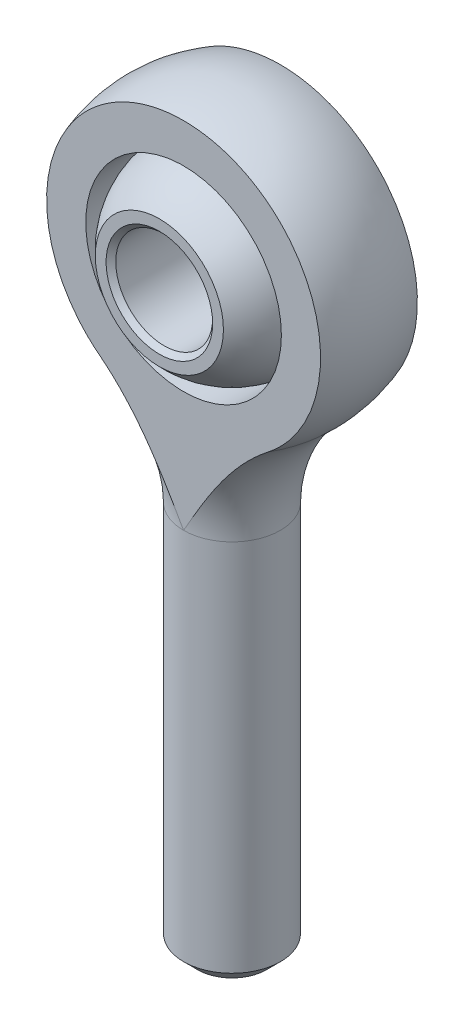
ISO-10303-21;
HEADER;
FILE_DESCRIPTION(('STEP AP214'),'2;1');
FILE_NAME('part.step','',(''),(''),'','','');
FILE_SCHEMA(('AUTOMOTIVE_DESIGN { 1 0 10303 214 1 1 1 1 }'));
ENDSEC;
DATA;
#1=APPLICATION_CONTEXT('core data for automotive mechanical design processes');
#2=APPLICATION_PROTOCOL_DEFINITION('international standard','automotive_design',2000,#1);
#3=PRODUCT_CONTEXT('',#1,'mechanical');
#4=PRODUCT('Part','Part','',(#3));
#5=PRODUCT_RELATED_PRODUCT_CATEGORY('part','',(#4));
#6=PRODUCT_DEFINITION_FORMATION('','',#4);
#7=PRODUCT_DEFINITION_CONTEXT('part definition',#1,'design');
#8=PRODUCT_DEFINITION('design','',#6,#7);
#9=PRODUCT_DEFINITION_SHAPE('','',#8);
#10=(LENGTH_UNIT() NAMED_UNIT(*) SI_UNIT(.MILLI.,.METRE.));
#11=(NAMED_UNIT(*) PLANE_ANGLE_UNIT() SI_UNIT($,.RADIAN.));
#12=(NAMED_UNIT(*) SI_UNIT($,.STERADIAN.) SOLID_ANGLE_UNIT());
#13=UNCERTAINTY_MEASURE_WITH_UNIT(LENGTH_MEASURE(1.E-05),#10,'distance_accuracy_value','');
#14=(GEOMETRIC_REPRESENTATION_CONTEXT(3) GLOBAL_UNCERTAINTY_ASSIGNED_CONTEXT((#13)) GLOBAL_UNIT_ASSIGNED_CONTEXT((#10,
#11,#12)) REPRESENTATION_CONTEXT('',''));
#15=CARTESIAN_POINT('',(0.,0.,0.));
#16=DIRECTION('',(0.,0.,1.));
#17=DIRECTION('',(1.,0.,0.));
#18=AXIS2_PLACEMENT_3D('',#15,#16,#17);
#19=CARTESIAN_POINT('',(0.,14.2875,0.));
#20=DIRECTION('',(0.,-1.,0.));
#21=DIRECTION('',(-1.,0.,0.));
#22=AXIS2_PLACEMENT_3D('',#19,#20,#21);
#23=SPHERICAL_SURFACE('',#22,6.35);
#24=CARTESIAN_POINT('',(0.,14.2875,0.));
#25=DIRECTION('',(0.,0.,1.));
#26=DIRECTION('',(0.,-1.,0.));
#27=AXIS2_PLACEMENT_3D('',#24,#25,#26);
#28=SPHERICAL_SURFACE('',#27,6.35);
#29=CARTESIAN_POINT('',(0.,14.2875,-4.7625));
#30=DIRECTION('',(0.,0.,1.));
#31=DIRECTION('',(0.,-1.,0.));
#32=AXIS2_PLACEMENT_3D('',#29,#30,#31);
#33=CIRCLE('',#32,4.20013020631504);
#34=CARTESIAN_POINT('',(0.,10.087369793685,-4.7625));
#35=VERTEX_POINT('',#34);
#36=EDGE_CURVE('E63',#35,#35,#33,.F.);
#37=ORIENTED_EDGE('',*,*,#36,.F.);
#38=EDGE_LOOP('',(#37));
#39=FACE_BOUND('',#38,.T.);
#40=CARTESIAN_POINT('',(0.,14.2875,4.7625));
#41=DIRECTION('',(0.,0.,-1.));
#42=DIRECTION('',(0.,1.,0.));
#43=AXIS2_PLACEMENT_3D('',#40,#41,#42);
#44=CIRCLE('',#43,4.20013020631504);
#45=CARTESIAN_POINT('',(0.,18.487630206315,4.7625));
#46=VERTEX_POINT('',#45);
#47=EDGE_CURVE('E62',#46,#46,#44,.F.);
#48=ORIENTED_EDGE('',*,*,#47,.F.);
#49=EDGE_LOOP('',(#48));
#50=FACE_BOUND('',#49,.T.);
#51=ADVANCED_FACE('F42',(#39,#50),#28,.T.);
#52=CARTESIAN_POINT('',(-9.525,23.8125,4.7625));
#53=DIRECTION('',(0.,0.,-1.));
#54=DIRECTION('',(0.,1.,0.));
#55=AXIS2_PLACEMENT_3D('',#52,#53,#54);
#56=PLANE('',#55);
#57=CARTESIAN_POINT('',(0.,14.2875,4.7625));
#58=DIRECTION('',(0.,0.,-1.));
#59=DIRECTION('',(0.,1.,0.));
#60=AXIS2_PLACEMENT_3D('',#57,#58,#59);
#61=CIRCLE('',#60,3.4925);
#62=CARTESIAN_POINT('',(0.,17.78,4.7625));
#63=VERTEX_POINT('',#62);
#64=EDGE_CURVE('E11',#63,#63,#61,.T.);
#65=ORIENTED_EDGE('',*,*,#64,.T.);
#66=EDGE_LOOP('',(#65));
#67=FACE_BOUND('',#66,.T.);
#68=ORIENTED_EDGE('',*,*,#47,.T.);
#69=EDGE_LOOP('',(#68));
#70=FACE_BOUND('',#69,.T.);
#71=ADVANCED_FACE('F69',(#67,#70),#56,.F.);
#72=CARTESIAN_POINT('',(-9.525,23.8125,-4.7625));
#73=DIRECTION('',(0.,0.,1.));
#74=DIRECTION('',(0.,-1.,0.));
#75=AXIS2_PLACEMENT_3D('',#72,#73,#74);
#76=PLANE('',#75);
#77=CARTESIAN_POINT('',(0.,14.2875,-4.7625));
#78=DIRECTION('',(0.,0.,1.));
#79=DIRECTION('',(0.,-1.,0.));
#80=AXIS2_PLACEMENT_3D('',#77,#78,#79);
#81=CIRCLE('',#80,3.4925);
#82=CARTESIAN_POINT('',(0.,10.795,-4.7625));
#83=VERTEX_POINT('',#82);
#84=EDGE_CURVE('E57',#83,#83,#81,.T.);
#85=ORIENTED_EDGE('',*,*,#84,.T.);
#86=EDGE_LOOP('',(#85));
#87=FACE_BOUND('',#86,.T.);
#88=ORIENTED_EDGE('',*,*,#36,.T.);
#89=EDGE_LOOP('',(#88));
#90=FACE_BOUND('',#89,.T.);
#91=ADVANCED_FACE('F77',(#87,#90),#76,.F.);
#92=CARTESIAN_POINT('',(0.,14.2875,-4.7625));
#93=DIRECTION('',(0.,0.,1.));
#94=DIRECTION('',(1.,0.,0.));
#95=AXIS2_PLACEMENT_3D('',#92,#93,#94);
#96=CYLINDRICAL_SURFACE('',#95,3.175);
#97=CARTESIAN_POINT('',(0.,14.2875,-4.445));
#98=DIRECTION('',(0.,0.,1.));
#99=DIRECTION('',(1.,0.,0.));
#100=AXIS2_PLACEMENT_3D('',#97,#98,#99);
#101=CIRCLE('',#100,3.175);
#102=CARTESIAN_POINT('',(3.175,14.2875,-4.445));
#103=VERTEX_POINT('',#102);
#104=EDGE_CURVE('E49',#103,#103,#101,.F.);
#105=ORIENTED_EDGE('',*,*,#104,.T.);
#106=EDGE_LOOP('',(#105));
#107=FACE_BOUND('',#106,.T.);
#108=CARTESIAN_POINT('',(0.,14.2875,4.445));
#109=DIRECTION('',(0.,0.,-1.));
#110=DIRECTION('',(-1.,0.,0.));
#111=AXIS2_PLACEMENT_3D('',#108,#109,#110);
#112=CIRCLE('',#111,3.175);
#113=CARTESIAN_POINT('',(-3.175,14.2875,4.445));
#114=VERTEX_POINT('',#113);
#115=EDGE_CURVE('E53',#114,#114,#112,.F.);
#116=ORIENTED_EDGE('',*,*,#115,.T.);
#117=EDGE_LOOP('',(#116));
#118=FACE_BOUND('',#117,.T.);
#119=ADVANCED_FACE('F83',(#107,#118),#96,.F.);
#120=CARTESIAN_POINT('',(0.,14.2875,-4.7625));
#121=DIRECTION('',(0.,0.,-1.));
#122=DIRECTION('',(-1.,0.,0.));
#123=AXIS2_PLACEMENT_3D('',#120,#121,#122);
#124=CONICAL_SURFACE('',#123,3.4925,0.785398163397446);
#125=ORIENTED_EDGE('',*,*,#104,.F.);
#126=EDGE_LOOP('',(#125));
#127=FACE_BOUND('',#126,.T.);
#128=ORIENTED_EDGE('',*,*,#84,.F.);
#129=EDGE_LOOP('',(#128));
#130=FACE_BOUND('',#129,.T.);
#131=ADVANCED_FACE('F81',(#127,#130),#124,.F.);
#132=CARTESIAN_POINT('',(0.,14.2875,4.445));
#133=DIRECTION('',(0.,0.,1.));
#134=DIRECTION('',(1.,0.,0.));
#135=AXIS2_PLACEMENT_3D('',#132,#133,#134);
#136=CONICAL_SURFACE('',#135,3.175,0.785398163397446);
#137=ORIENTED_EDGE('',*,*,#64,.F.);
#138=EDGE_LOOP('',(#137));
#139=FACE_BOUND('',#138,.T.);
#140=ORIENTED_EDGE('',*,*,#115,.F.);
#141=EDGE_LOOP('',(#140));
#142=FACE_BOUND('',#141,.T.);
#143=ADVANCED_FACE('F44',(#139,#142),#136,.F.);
#144=CLOSED_SHELL('',(#51,#71,#91,#119,#131,#143));
#145=MANIFOLD_SOLID_BREP('B2',#144);
#146=CARTESIAN_POINT('',(0.,0.,0.));
#147=DIRECTION('',(0.,-1.,0.));
#148=DIRECTION('',(1.,0.,0.));
#149=AXIS2_PLACEMENT_3D('',#146,#147,#148);
#150=TOROIDAL_SURFACE('',#149,12.8984375,9.72343750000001);
#151=CARTESIAN_POINT('',(0.,0.,-3.17500000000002));
#152=CARTESIAN_POINT('',(-0.00326153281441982,0.005707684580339,-3.17500000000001));
#153=CARTESIAN_POINT('',(-0.00652306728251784,0.0114153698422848,-3.17500000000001));
#154=CARTESIAN_POINT('',(-0.273129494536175,0.477974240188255,-3.17499999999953));
#155=CARTESIAN_POINT('',(-0.536560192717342,0.938786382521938,-3.17499999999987));
#156=CARTESIAN_POINT('',(-1.07566265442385,1.8532278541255,-3.17500000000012));
#157=CARTESIAN_POINT('',(-1.35133223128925,2.30685844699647,-3.17500000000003));
#158=CARTESIAN_POINT('',(-1.92559609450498,3.19894900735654,-3.17499999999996));
#159=CARTESIAN_POINT('',(-2.22416629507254,3.63742422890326,-3.17499999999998));
#160=CARTESIAN_POINT('',(-2.85309895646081,4.49102276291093,-3.175));
#161=CARTESIAN_POINT('',(-3.18344395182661,4.90615870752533,-3.17499999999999));
#162=CARTESIAN_POINT('',(-3.77466960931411,5.58162755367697,-3.17499999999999));
#163=CARTESIAN_POINT('',(-4.02585009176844,5.85044049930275,-3.17499999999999));
#164=CARTESIAN_POINT('',(-4.54711374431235,6.36901465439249,-3.17499999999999));
#165=CARTESIAN_POINT('',(-4.8171908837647,6.61878188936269,-3.17499999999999));
#166=CARTESIAN_POINT('',(-5.37662445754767,7.09612768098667,-3.17499999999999));
#167=CARTESIAN_POINT('',(-5.66599147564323,7.32369388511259,-3.17499999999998));
#168=CARTESIAN_POINT('',(-6.26322715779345,7.75319037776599,-3.17499999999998));
#169=CARTESIAN_POINT('',(-6.57109562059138,7.95512094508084,-3.17499999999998));
#170=CARTESIAN_POINT('',(-7.20718830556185,8.33213779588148,-3.17499999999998));
#171=CARTESIAN_POINT('',(-7.5355887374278,8.50692791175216,-3.17499999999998));
#172=CARTESIAN_POINT('',(-8.20771747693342,8.8241919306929,-3.17499999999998));
#173=CARTESIAN_POINT('',(-8.55144656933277,8.96666417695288,-3.17499999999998));
#174=CARTESIAN_POINT('',(-9.25110720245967,9.21656726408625,-3.17499999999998));
#175=CARTESIAN_POINT('',(-9.60702765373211,9.32402906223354,-3.17499999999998));
#176=CARTESIAN_POINT('',(-10.3280020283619,9.50191139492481,-3.17499999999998));
#177=CARTESIAN_POINT('',(-10.6930544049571,9.57233815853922,-3.17499999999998));
#178=CARTESIAN_POINT('',(-11.3741481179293,9.66696888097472,-3.17499999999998));
#179=CARTESIAN_POINT('',(-11.6894621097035,9.69646466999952,-3.17499999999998));
#180=CARTESIAN_POINT('',(-12.3214131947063,9.72667494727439,-3.17499999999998));
#181=CARTESIAN_POINT('',(-12.6380499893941,9.72739561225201,-3.17499999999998));
#182=CARTESIAN_POINT('',(-13.2714560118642,9.69958458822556,-3.17499999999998));
#183=CARTESIAN_POINT('',(-13.5882199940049,9.67092754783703,-3.17499999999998));
#184=CARTESIAN_POINT('',(-14.0603016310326,9.60580647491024,-3.17499999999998));
#185=CARTESIAN_POINT('',(-14.2172131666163,9.58039570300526,-3.17499999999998));
#186=CARTESIAN_POINT('',(-14.5296709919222,9.5222100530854,-3.17499999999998));
#187=CARTESIAN_POINT('',(-14.6852172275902,9.48943488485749,-3.17499999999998));
#188=CARTESIAN_POINT('',(-14.8399244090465,9.45298870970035,-3.17499999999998));
#189=B_SPLINE_CURVE_WITH_KNOTS('',3,(#151,#152,#153,#154,#155,#156,#157,#158,#159,#160,#161,
#162,#163,#164,#165,#166,#167,#168,#169,#170,#171,#172,#173,#174,#175,#176,#177,#178,#179,#180,
#181,#182,#183,#184,#185,#186,#187,#188),.UNSPECIFIED.,.F.,.F.,(4,2,2,2,2,2,2,2,2,2,2,2,2,2,2,2,
2,2,4),(0.,0.0197214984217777,1.6120807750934,3.20415668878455,4.79458050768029,
6.38413507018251,7.48699761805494,8.58950979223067,9.692631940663,10.7957420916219,
11.9101519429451,13.0246189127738,14.1380977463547,15.2513892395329,16.2001992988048,
17.1488056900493,18.1014765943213,18.5781908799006,19.0549239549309),.UNSPECIFIED.);
#190=CARTESIAN_POINT('',(0.,0.,-3.175));
#191=VERTEX_POINT('',#190);
#192=CARTESIAN_POINT('',(-5.53702467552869,7.21739690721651,-3.17499999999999));
#193=VERTEX_POINT('',#192);
#194=EDGE_CURVE('E147',#191,#193,#189,.T.);
#195=ORIENTED_EDGE('',*,*,#194,.F.);
#196=CARTESIAN_POINT('',(0.,0.,0.));
#197=DIRECTION('',(0.,1.,0.));
#198=DIRECTION('',(-1.,0.,0.));
#199=AXIS2_PLACEMENT_3D('',#196,#197,#198);
#200=CIRCLE('',#199,3.175);
#201=CARTESIAN_POINT('',(0.,0.,3.175));
#202=VERTEX_POINT('',#201);
#203=EDGE_CURVE('E175',#191,#202,#200,.T.);
#204=ORIENTED_EDGE('',*,*,#203,.T.);
#205=CARTESIAN_POINT('',(0.,0.,3.17500000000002));
#206=CARTESIAN_POINT('',(-0.00326153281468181,0.00570768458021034,3.17500000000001));
#207=CARTESIAN_POINT('',(-0.00652306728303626,0.0114153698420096,3.175));
#208=CARTESIAN_POINT('',(-0.273129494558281,0.477974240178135,3.17499999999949));
#209=CARTESIAN_POINT('',(-0.536560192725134,0.938786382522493,3.17499999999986));
#210=CARTESIAN_POINT('',(-1.07566265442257,1.853227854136,3.17500000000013));
#211=CARTESIAN_POINT('',(-1.35133223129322,2.30685844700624,3.17500000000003));
#212=CARTESIAN_POINT('',(-1.92559609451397,3.19894900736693,3.17499999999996));
#213=CARTESIAN_POINT('',(-2.22416629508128,3.63742422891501,3.17499999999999));
#214=CARTESIAN_POINT('',(-2.85309895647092,4.49102276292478,3.17500000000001));
#215=CARTESIAN_POINT('',(-3.18344395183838,4.90615870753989,3.175));
#216=CARTESIAN_POINT('',(-3.77466960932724,5.58162755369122,3.175));
#217=CARTESIAN_POINT('',(-4.02585009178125,5.85044049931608,3.175));
#218=CARTESIAN_POINT('',(-4.54711374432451,6.36901465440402,3.175));
#219=CARTESIAN_POINT('',(-4.81719088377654,6.61878188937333,3.175));
#220=CARTESIAN_POINT('',(-5.37662445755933,7.0961276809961,3.175));
#221=CARTESIAN_POINT('',(-5.66599147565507,7.32369388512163,3.175));
#222=CARTESIAN_POINT('',(-6.26322715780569,7.75319037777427,3.175));
#223=CARTESIAN_POINT('',(-6.57109562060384,7.95512094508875,3.175));
#224=CARTESIAN_POINT('',(-7.20718830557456,8.33213779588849,3.175));
#225=CARTESIAN_POINT('',(-7.53558873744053,8.50692791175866,3.175));
#226=CARTESIAN_POINT('',(-8.2077174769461,8.82419193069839,3.175));
#227=CARTESIAN_POINT('',(-8.5514465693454,8.96666417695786,3.175));
#228=CARTESIAN_POINT('',(-9.25110720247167,9.21656726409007,3.175));
#229=CARTESIAN_POINT('',(-9.60702765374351,9.32402906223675,3.175));
#230=CARTESIAN_POINT('',(-10.328002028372,9.50191139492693,3.175));
#231=CARTESIAN_POINT('',(-10.6930544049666,9.57233815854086,3.175));
#232=CARTESIAN_POINT('',(-11.3741481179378,9.66696888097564,3.175));
#233=CARTESIAN_POINT('',(-11.6894621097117,9.69646467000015,3.175));
#234=CARTESIAN_POINT('',(-12.3214131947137,9.72667494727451,3.175));
#235=CARTESIAN_POINT('',(-12.6380499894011,9.72739561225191,3.175));
#236=CARTESIAN_POINT('',(-13.2714560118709,9.69958458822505,3.175));
#237=CARTESIAN_POINT('',(-13.5882199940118,9.67092754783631,3.175));
#238=CARTESIAN_POINT('',(-14.0603016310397,9.60580647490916,3.175));
#239=CARTESIAN_POINT('',(-14.2172131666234,9.58039570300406,3.175));
#240=CARTESIAN_POINT('',(-14.5296709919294,9.52221005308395,3.175));
#241=CARTESIAN_POINT('',(-14.6852172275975,9.48943488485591,3.175));
#242=CARTESIAN_POINT('',(-14.8399244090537,9.45298870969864,3.175));
#243=B_SPLINE_CURVE_WITH_KNOTS('',3,(#205,#206,#207,#208,#209,#210,#211,#212,#213,#214,#215,
#216,#217,#218,#219,#220,#221,#222,#223,#224,#225,#226,#227,#228,#229,#230,#231,#232,#233,#234,
#235,#236,#237,#238,#239,#240,#241,#242),.UNSPECIFIED.,.F.,.F.,(4,2,2,2,2,2,2,2,2,2,2,2,2,2,2,2,
2,2,4),(0.,0.0197214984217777,1.61208077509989,3.20415668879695,4.79458050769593,
6.38413507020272,7.48699761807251,8.58950979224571,9.69263194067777,10.7957420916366,
11.9101519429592,13.0246189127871,14.1380977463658,15.2513892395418,16.2001992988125,
17.1488056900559,18.1014765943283,18.5781908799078,19.0549239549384),.UNSPECIFIED.);
#244=CARTESIAN_POINT('',(-5.53702467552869,7.21739690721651,3.175));
#245=VERTEX_POINT('',#244);
#246=EDGE_CURVE('E179',#245,#202,#243,.F.);
#247=ORIENTED_EDGE('',*,*,#246,.F.);
#248=CARTESIAN_POINT('',(0.,7.21739690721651,0.));
#249=DIRECTION('',(0.,-1.,0.));
#250=DIRECTION('',(1.,0.,0.));
#251=AXIS2_PLACEMENT_3D('',#248,#249,#250);
#252=CIRCLE('',#251,6.38273195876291);
#253=EDGE_CURVE('E178',#245,#193,#252,.T.);
#254=ORIENTED_EDGE('',*,*,#253,.T.);
#255=EDGE_LOOP('',(#195,#204,#247,#254));
#256=FACE_BOUND('',#255,.T.);
#257=ADVANCED_FACE('F133',(#256),#150,.F.);
#258=CARTESIAN_POINT('',(0.,-25.4,0.));
#259=DIRECTION('',(0.,1.,0.));
#260=DIRECTION('',(-1.,0.,0.));
#261=AXIS2_PLACEMENT_3D('',#258,#259,#260);
#262=PLANE('',#261);
#263=CARTESIAN_POINT('',(0.,-25.4,0.));
#264=DIRECTION('',(0.,1.,0.));
#265=DIRECTION('',(-1.,0.,0.));
#266=AXIS2_PLACEMENT_3D('',#263,#264,#265);
#267=CIRCLE('',#266,2.26822);
#268=CARTESIAN_POINT('',(-2.26822,-25.4,0.));
#269=VERTEX_POINT('',#268);
#270=EDGE_CURVE('E190',#269,#269,#267,.F.);
#271=ORIENTED_EDGE('',*,*,#270,.T.);
#272=EDGE_LOOP('',(#271));
#273=FACE_BOUND('',#272,.T.);
#274=ADVANCED_FACE('F225',(#273),#262,.F.);
#275=CARTESIAN_POINT('',(0.,23.8125,0.));
#276=DIRECTION('',(0.,1.,0.));
#277=DIRECTION('',(-1.,0.,0.));
#278=AXIS2_PLACEMENT_3D('',#275,#276,#277);
#279=CYLINDRICAL_SURFACE('',#278,3.175);
#280=CARTESIAN_POINT('',(0.,-24.49322,0.));
#281=DIRECTION('',(0.,1.,0.));
#282=DIRECTION('',(-1.,0.,0.));
#283=AXIS2_PLACEMENT_3D('',#280,#281,#282);
#284=CIRCLE('',#283,3.175);
#285=CARTESIAN_POINT('',(-3.175,-24.49322,0.));
#286=VERTEX_POINT('',#285);
#287=EDGE_CURVE('E188',#286,#286,#284,.T.);
#288=ORIENTED_EDGE('',*,*,#287,.T.);
#289=EDGE_LOOP('',(#288));
#290=FACE_BOUND('',#289,.T.);
#291=EDGE_CURVE('E184',#202,#191,#200,.T.);
#292=ORIENTED_EDGE('',*,*,#291,.F.);
#293=ORIENTED_EDGE('',*,*,#203,.F.);
#294=EDGE_LOOP('',(#292,#293));
#295=FACE_BOUND('',#294,.T.);
#296=ADVANCED_FACE('F183',(#290,#295),#279,.T.);
#297=CARTESIAN_POINT('',(0.,-24.49322,0.));
#298=DIRECTION('',(0.,1.,0.));
#299=DIRECTION('',(-1.,0.,0.));
#300=AXIS2_PLACEMENT_3D('',#297,#298,#299);
#301=CONICAL_SURFACE('',#300,3.175,0.785398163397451);
#302=ORIENTED_EDGE('',*,*,#270,.F.);
#303=EDGE_LOOP('',(#302));
#304=FACE_BOUND('',#303,.T.);
#305=ORIENTED_EDGE('',*,*,#287,.F.);
#306=EDGE_LOOP('',(#305));
#307=FACE_BOUND('',#306,.T.);
#308=ADVANCED_FACE('F135',(#304,#307),#301,.T.);
#309=CARTESIAN_POINT('',(0.,0.,-3.17500000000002));
#310=CARTESIAN_POINT('',(0.00326153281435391,0.005707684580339,-3.17500000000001));
#311=CARTESIAN_POINT('',(0.00652306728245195,0.0114153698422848,-3.17500000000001));
#312=CARTESIAN_POINT('',(0.273129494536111,0.477974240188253,-3.17499999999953));
#313=CARTESIAN_POINT('',(0.536560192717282,0.938786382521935,-3.17499999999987));
#314=CARTESIAN_POINT('',(1.07566265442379,1.8532278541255,-3.17500000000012));
#315=CARTESIAN_POINT('',(1.35133223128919,2.30685844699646,-3.17500000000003));
#316=CARTESIAN_POINT('',(1.92559609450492,3.19894900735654,-3.17499999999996));
#317=CARTESIAN_POINT('',(2.22416629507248,3.63742422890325,-3.17499999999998));
#318=CARTESIAN_POINT('',(2.85309895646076,4.49102276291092,-3.175));
#319=CARTESIAN_POINT('',(3.18344395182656,4.90615870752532,-3.17499999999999));
#320=CARTESIAN_POINT('',(3.77466960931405,5.58162755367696,-3.17499999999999));
#321=CARTESIAN_POINT('',(4.02585009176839,5.85044049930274,-3.17499999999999));
#322=CARTESIAN_POINT('',(4.54711374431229,6.36901465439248,-3.17499999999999));
#323=CARTESIAN_POINT('',(4.81719088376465,6.61878188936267,-3.17499999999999));
#324=CARTESIAN_POINT('',(5.37662445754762,7.09612768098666,-3.17499999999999));
#325=CARTESIAN_POINT('',(5.66599147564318,7.32369388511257,-3.17499999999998));
#326=CARTESIAN_POINT('',(6.2632271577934,7.75319037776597,-3.17499999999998));
#327=CARTESIAN_POINT('',(6.57109562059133,7.95512094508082,-3.17499999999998));
#328=CARTESIAN_POINT('',(7.2071883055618,8.33213779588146,-3.17499999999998));
#329=CARTESIAN_POINT('',(7.53558873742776,8.50692791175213,-3.17499999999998));
#330=CARTESIAN_POINT('',(8.20771747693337,8.82419193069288,-3.17499999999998));
#331=CARTESIAN_POINT('',(8.55144656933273,8.96666417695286,-3.17499999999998));
#332=CARTESIAN_POINT('',(9.25110720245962,9.21656726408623,-3.17499999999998));
#333=CARTESIAN_POINT('',(9.60702765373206,9.32402906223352,-3.17499999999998));
#334=CARTESIAN_POINT('',(10.3280020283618,9.50191139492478,-3.17499999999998));
#335=CARTESIAN_POINT('',(10.6930544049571,9.57233815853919,-3.17499999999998));
#336=CARTESIAN_POINT('',(11.3741481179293,9.6669688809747,-3.17499999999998));
#337=CARTESIAN_POINT('',(11.6894621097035,9.69646466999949,-3.17499999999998));
#338=CARTESIAN_POINT('',(12.3214131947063,9.72667494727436,-3.17499999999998));
#339=CARTESIAN_POINT('',(12.638049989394,9.72739561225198,-3.17499999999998));
#340=CARTESIAN_POINT('',(13.2714560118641,9.69958458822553,-3.17499999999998));
#341=CARTESIAN_POINT('',(13.5882199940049,9.670927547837,-3.17499999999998));
#342=CARTESIAN_POINT('',(14.0603016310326,9.60580647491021,-3.17499999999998));
#343=CARTESIAN_POINT('',(14.2172131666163,9.58039570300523,-3.17499999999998));
#344=CARTESIAN_POINT('',(14.5296709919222,9.52221005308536,-3.17499999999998));
#345=CARTESIAN_POINT('',(14.6852172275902,9.48943488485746,-3.17499999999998));
#346=CARTESIAN_POINT('',(14.8399244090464,9.45298870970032,-3.17499999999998));
#347=B_SPLINE_CURVE_WITH_KNOTS('',3,(#309,#310,#311,#312,#313,#314,#315,#316,#317,#318,#319,
#320,#321,#322,#323,#324,#325,#326,#327,#328,#329,#330,#331,#332,#333,#334,#335,#336,#337,#338,
#339,#340,#341,#342,#343,#344,#345,#346),.UNSPECIFIED.,.F.,.F.,(4,2,2,2,2,2,2,2,2,2,2,2,2,2,2,2,
2,2,4),(0.,0.0197214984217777,1.6120807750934,3.20415668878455,4.79458050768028,
6.38413507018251,7.48699761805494,8.58950979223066,9.692631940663,10.7957420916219,
11.9101519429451,13.0246189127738,14.1380977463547,15.2513892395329,16.2001992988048,
17.1488056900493,18.1014765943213,18.5781908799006,19.0549239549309),.UNSPECIFIED.);
#348=CARTESIAN_POINT('',(5.53702467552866,7.2173969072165,-3.17499999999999));
#349=VERTEX_POINT('',#348);
#350=EDGE_CURVE('E166',#349,#191,#347,.F.);
#351=ORIENTED_EDGE('',*,*,#350,.F.);
#352=CARTESIAN_POINT('',(5.53702467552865,7.2173969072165,3.175));
#353=VERTEX_POINT('',#352);
#354=EDGE_CURVE('E155',#349,#353,#252,.T.);
#355=ORIENTED_EDGE('',*,*,#354,.T.);
#356=CARTESIAN_POINT('',(0.,0.,3.17500000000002));
#357=CARTESIAN_POINT('',(0.0032615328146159,0.00570768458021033,3.17500000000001));
#358=CARTESIAN_POINT('',(0.00652306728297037,0.0114153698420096,3.175));
#359=CARTESIAN_POINT('',(0.273129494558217,0.477974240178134,3.17499999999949));
#360=CARTESIAN_POINT('',(0.536560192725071,0.938786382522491,3.17499999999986));
#361=CARTESIAN_POINT('',(1.07566265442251,1.853227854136,3.17500000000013));
#362=CARTESIAN_POINT('',(1.35133223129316,2.30685844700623,3.17500000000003));
#363=CARTESIAN_POINT('',(1.92559609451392,3.19894900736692,3.17499999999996));
#364=CARTESIAN_POINT('',(2.22416629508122,3.637424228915,3.17499999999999));
#365=CARTESIAN_POINT('',(2.85309895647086,4.49102276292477,3.17500000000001));
#366=CARTESIAN_POINT('',(3.18344395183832,4.90615870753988,3.175));
#367=CARTESIAN_POINT('',(3.77466960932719,5.58162755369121,3.175));
#368=CARTESIAN_POINT('',(4.0258500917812,5.85044049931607,3.175));
#369=CARTESIAN_POINT('',(4.54711374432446,6.36901465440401,3.175));
#370=CARTESIAN_POINT('',(4.81719088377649,6.61878188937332,3.175));
#371=CARTESIAN_POINT('',(5.37662445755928,7.09612768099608,3.175));
#372=CARTESIAN_POINT('',(5.66599147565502,7.32369388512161,3.175));
#373=CARTESIAN_POINT('',(6.26322715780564,7.75319037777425,3.175));
#374=CARTESIAN_POINT('',(6.57109562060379,7.95512094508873,3.175));
#375=CARTESIAN_POINT('',(7.20718830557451,8.33213779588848,3.175));
#376=CARTESIAN_POINT('',(7.53558873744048,8.50692791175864,3.175));
#377=CARTESIAN_POINT('',(8.20771747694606,8.82419193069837,3.175));
#378=CARTESIAN_POINT('',(8.55144656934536,8.96666417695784,3.175));
#379=CARTESIAN_POINT('',(9.25110720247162,9.21656726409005,3.175));
#380=CARTESIAN_POINT('',(9.60702765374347,9.32402906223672,3.175));
#381=CARTESIAN_POINT('',(10.328002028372,9.5019113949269,3.175));
#382=CARTESIAN_POINT('',(10.6930544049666,9.57233815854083,3.175));
#383=CARTESIAN_POINT('',(11.3741481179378,9.66696888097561,3.175));
#384=CARTESIAN_POINT('',(11.6894621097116,9.69646467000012,3.175));
#385=CARTESIAN_POINT('',(12.3214131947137,9.72667494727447,3.175));
#386=CARTESIAN_POINT('',(12.638049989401,9.72739561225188,3.175));
#387=CARTESIAN_POINT('',(13.2714560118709,9.69958458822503,3.175));
#388=CARTESIAN_POINT('',(13.5882199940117,9.67092754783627,3.175));
#389=CARTESIAN_POINT('',(14.0603016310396,9.60580647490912,3.175));
#390=CARTESIAN_POINT('',(14.2172131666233,9.58039570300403,3.175));
#391=CARTESIAN_POINT('',(14.5296709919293,9.52221005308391,3.175));
#392=CARTESIAN_POINT('',(14.6852172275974,9.48943488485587,3.175));
#393=CARTESIAN_POINT('',(14.8399244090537,9.45298870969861,3.175));
#394=B_SPLINE_CURVE_WITH_KNOTS('',3,(#356,#357,#358,#359,#360,#361,#362,#363,#364,#365,#366,
#367,#368,#369,#370,#371,#372,#373,#374,#375,#376,#377,#378,#379,#380,#381,#382,#383,#384,#385,
#386,#387,#388,#389,#390,#391,#392,#393),.UNSPECIFIED.,.F.,.F.,(4,2,2,2,2,2,2,2,2,2,2,2,2,2,2,2,
2,2,4),(0.,0.0197214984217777,1.61208077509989,3.20415668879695,4.79458050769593,
6.38413507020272,7.48699761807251,8.58950979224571,9.69263194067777,10.7957420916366,
11.9101519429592,13.0246189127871,14.1380977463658,15.2513892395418,16.2001992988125,
17.1488056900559,18.1014765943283,18.5781908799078,19.0549239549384),.UNSPECIFIED.);
#395=EDGE_CURVE('E187',#202,#353,#394,.T.);
#396=ORIENTED_EDGE('',*,*,#395,.F.);
#397=ORIENTED_EDGE('',*,*,#291,.T.);
#398=EDGE_LOOP('',(#351,#355,#396,#397));
#399=FACE_BOUND('',#398,.T.);
#400=ADVANCED_FACE('F186',(#399),#150,.F.);
#401=CARTESIAN_POINT('',(0.,14.2875,0.));
#402=DIRECTION('',(0.,-1.,0.));
#403=DIRECTION('',(1.,0.,0.));
#404=AXIS2_PLACEMENT_3D('',#401,#402,#403);
#405=SPHERICAL_SURFACE('',#404,9.525);
#406=CARTESIAN_POINT('',(0.,14.2875,-3.17499999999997));
#407=DIRECTION('',(0.,0.,1.));
#408=DIRECTION('',(0.,-1.,0.));
#409=AXIS2_PLACEMENT_3D('',#406,#407,#408);
#410=CIRCLE('',#409,8.98025612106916);
#411=EDGE_CURVE('E40',#193,#349,#410,.F.);
#412=ORIENTED_EDGE('',*,*,#411,.F.);
#413=ORIENTED_EDGE('',*,*,#253,.F.);
#414=CARTESIAN_POINT('',(0.,14.2875,3.175));
#415=DIRECTION('',(0.,0.,-1.));
#416=DIRECTION('',(0.,1.,0.));
#417=AXIS2_PLACEMENT_3D('',#414,#415,#416);
#418=CIRCLE('',#417,8.98025612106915);
#419=EDGE_CURVE('E141',#353,#245,#418,.F.);
#420=ORIENTED_EDGE('',*,*,#419,.F.);
#421=ORIENTED_EDGE('',*,*,#354,.F.);
#422=EDGE_LOOP('',(#412,#413,#420,#421));
#423=FACE_BOUND('',#422,.T.);
#424=ADVANCED_FACE('F201',(#423),#405,.T.);
#425=CARTESIAN_POINT('',(-9.525,23.8125,3.175));
#426=DIRECTION('',(0.,0.,-1.));
#427=DIRECTION('',(0.,1.,0.));
#428=AXIS2_PLACEMENT_3D('',#425,#426,#427);
#429=PLANE('',#428);
#430=CARTESIAN_POINT('',(0.,14.2875,3.175));
#431=DIRECTION('',(0.,0.,1.));
#432=DIRECTION('',(1.,0.,0.));
#433=AXIS2_PLACEMENT_3D('',#430,#431,#432);
#434=CIRCLE('',#433,6.4135);
#435=CARTESIAN_POINT('',(6.4135,14.2875,3.175));
#436=VERTEX_POINT('',#435);
#437=EDGE_CURVE('E288',#436,#436,#434,.T.);
#438=ORIENTED_EDGE('',*,*,#437,.F.);
#439=EDGE_LOOP('',(#438));
#440=FACE_BOUND('',#439,.T.);
#441=ORIENTED_EDGE('',*,*,#395,.T.);
#442=ORIENTED_EDGE('',*,*,#419,.T.);
#443=ORIENTED_EDGE('',*,*,#246,.T.);
#444=EDGE_LOOP('',(#441,#442,#443));
#445=FACE_BOUND('',#444,.T.);
#446=ADVANCED_FACE('F198',(#440,#445),#429,.F.);
#447=CARTESIAN_POINT('',(-9.525,0.,-3.175));
#448=DIRECTION('',(0.,0.,1.));
#449=DIRECTION('',(0.,-1.,0.));
#450=AXIS2_PLACEMENT_3D('',#447,#448,#449);
#451=PLANE('',#450);
#452=CARTESIAN_POINT('',(0.,14.2875,-3.175));
#453=DIRECTION('',(0.,0.,1.));
#454=DIRECTION('',(1.,0.,0.));
#455=AXIS2_PLACEMENT_3D('',#452,#453,#454);
#456=CIRCLE('',#455,6.4135);
#457=CARTESIAN_POINT('',(6.4135,14.2875,-3.175));
#458=VERTEX_POINT('',#457);
#459=EDGE_CURVE('E169',#458,#458,#456,.T.);
#460=ORIENTED_EDGE('',*,*,#459,.T.);
#461=EDGE_LOOP('',(#460));
#462=FACE_BOUND('',#461,.T.);
#463=ORIENTED_EDGE('',*,*,#194,.T.);
#464=ORIENTED_EDGE('',*,*,#411,.T.);
#465=ORIENTED_EDGE('',*,*,#350,.T.);
#466=EDGE_LOOP('',(#463,#464,#465));
#467=FACE_BOUND('',#466,.T.);
#468=ADVANCED_FACE('F167',(#462,#467),#451,.F.);
#469=CARTESIAN_POINT('',(0.,14.2875,-3.175));
#470=DIRECTION('',(0.,0.,1.));
#471=DIRECTION('',(1.,0.,0.));
#472=AXIS2_PLACEMENT_3D('',#469,#470,#471);
#473=CYLINDRICAL_SURFACE('',#472,6.4135);
#474=ORIENTED_EDGE('',*,*,#459,.F.);
#475=EDGE_LOOP('',(#474));
#476=FACE_BOUND('',#475,.T.);
#477=ORIENTED_EDGE('',*,*,#437,.T.);
#478=EDGE_LOOP('',(#477));
#479=FACE_BOUND('',#478,.T.);
#480=ADVANCED_FACE('F271',(#476,#479),#473,.F.);
#481=CLOSED_SHELL('',(#257,#274,#296,#308,#400,#424,#446,#468,#480));
#482=MANIFOLD_SOLID_BREP('B6',#481);
#483=ADVANCED_BREP_SHAPE_REPRESENTATION('',(#18,#145,#482),#14);
#484=SHAPE_DEFINITION_REPRESENTATION(#9,#483);
ENDSEC;
END-ISO-10303-21;
